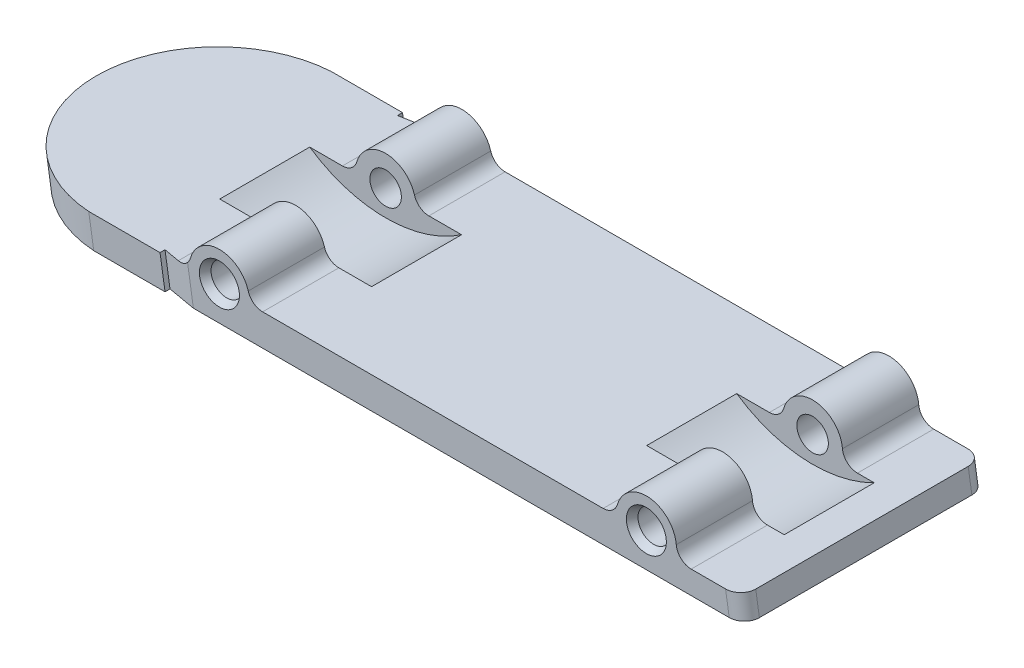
from build123d import *
from OCP.BRepFilletAPI import BRepFilletAPI_MakeChamfer

# Parameters (mm, degrees)
SKETCH1_R           = 0.8001
BOSS_EXTRUDE1_DEPTH = 12.319
CUT_EXTRUDE1_DEPTH  = 12.319
CUT_EXTRUDE2_DEPTH  = 6.1595
CUT_EXTRUDE3_DEPTH  = 2.286
CHAMFER1_SIZE       = 0.2159
CHAMFER1_SIZE2      = 0.373949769
FILLET1_R           = 0.762
FILLET2_R           = 0.762


with BuildPart() as part:
    # Sketch1 → Boss-Extrude1 (new body)
    with BuildSketch(Plane.XY):
        with BuildLine():
            Line((0, 0), (-0.253446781, 1.6002))
            Line((-0.253446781, 1.6002), (9.96475014, 1.6002))
            ThreePointArc((9.96475014, 1.6002), (10.422655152, 1.753129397), (10.696761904, 2.150533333))
            ThreePointArc((10.696761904, 2.150533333), (12.160785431, 3.2512), (13.624808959, 2.150533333))
            ThreePointArc((13.624808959, 2.150533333), (13.898915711, 1.753129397), (14.356820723, 1.6002))
            Line((14.356820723, 1.6002), (31.65635014, 1.6002))
            ThreePointArc((31.65635014, 1.6002), (32.114255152, 1.753129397), (32.388361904, 2.150533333))
            ThreePointArc((32.388361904, 2.150533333), (33.998824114, 3.244148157), (35.370352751, 1.862666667))
            ThreePointArc((35.370352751, 1.862666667), (35.615025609, 1.368147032), (36.12933641, 1.1684))
            Line((36.12933641, 1.1684), (38.647031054, 1.1684))
            Line((38.647031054, 1.1684), (38.832087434, 0))
            Line((38.832087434, 0), (0, 0))
        make_face()
        with Locations(Location((12.160785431, 1.7272, 0), (0, 0, 180))):
            Circle(SKETCH1_R, mode=Mode.SUBTRACT)
        with Locations(Location((33.852385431, 1.7272, 0), (0, 0, 180))):
            Circle(SKETCH1_R, mode=Mode.SUBTRACT)
    extrude(amount=BOSS_EXTRUDE1_DEPTH)

    # Sketch2 → Cut-Extrude1 (cut, along a direction that is not the sketch's normal)
    with BuildSketch(Plane(origin=(0, 1.6002, 0), x_dir=(1, 0, 0), z_dir=(0, 1, 0))):
        with BuildLine():
            ThreePointArc((5.523010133, -12.319), (1.416606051, -10.381670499), (-0.253446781, -6.159500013))
            Line((-0.253446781, -6.159500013), (-0.253446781, -12.319))
            Line((-0.253446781, -12.319), (5.523010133, -12.319))
        make_face()
        with BuildLine():
            ThreePointArc((-0.253446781, -6.159500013), (1.416606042, -1.93732951), (5.523010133, 0))
            Line((5.523010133, 0), (-0.253446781, 0))
            Line((-0.253446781, 0), (-0.253446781, -6.159500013))
        make_face()
    extrude(amount=-CUT_EXTRUDE1_DEPTH, dir=(-0.15643446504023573, 0.987688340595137, 0), mode=Mode.SUBTRACT)

    # Sketch4 → Cut-Extrude2 (cut, symmetric, along a direction that is not the sketch's normal)
    with BuildSketch(Plane(origin=(0, 1.6002, 0), x_dir=(1, 0, 0), z_dir=(0, 1, 0))):
        Polygon((9.144553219, 0), (9.144553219, -0.254), (10.585058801, 0), align=None)
        Polygon((9.144553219, -12.319), (10.585058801, -12.319), (9.144553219, -12.065), align=None)
    extrude(amount=CUT_EXTRUDE2_DEPTH, dir=(-0.1564344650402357, 0.987688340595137, 0), both=True, mode=Mode.SUBTRACT)

    # Sketch5 → Cut-Extrude3 (cut, symmetric)
    with BuildSketch(Plane.XY.offset(6.1595)):
        with BuildLine():
            Line((5.91803305, 4.431967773), (18.169658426, 3.965627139))
            ThreePointArc((18.169658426, 3.965627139), (11.899934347, 0.417980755), (5.91803305, 4.431967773))
        make_face()
        with BuildLine():
            Line((27.728970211, 4.182984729), (40.034635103, 4.3025247))
            ThreePointArc((40.034635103, 4.3025247), (33.919002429, 0.413341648), (27.728970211, 4.182984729))
        make_face()
    extrude(amount=CUT_EXTRUDE3_DEPTH, both=True, mode=Mode.SUBTRACT)

    # Chamfer1: one chamfer whose edges measure the first distance from different faces: ONE call of the kernel's chamfer builder (chamfer() names one face for all edges)
    chamfer1_edges_1 = [part.edges().sort_by_distance(p)[0] for p in [
        (12.960885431, 1.7272, 0),
    ]]
    chamfer1_side_1 = [part.faces().sort_by_distance(p)[0] for p in [
        (12.960885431, 1.7272, 1.93675),
    ]]
    chamfer1_edges_2 = [part.edges().sort_by_distance(p)[0] for p in [
        (12.960885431, 1.7272, 12.319),
        (34.652485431, 1.7272, 12.319),
    ]]
    chamfer1_side_2 = [part.faces().sort_by_distance(p)[0] for p in [
        (24.217354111, 0.964486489, 12.319),
    ]]
    chamfer1_edges_3 = [part.edges().sort_by_distance(p)[0] for p in [
        (34.652485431, 1.7272, 0),
    ]]
    chamfer1_side_3 = [part.faces().sort_by_distance(p)[0] for p in [
        (34.652485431, 1.7272, 1.93675),
    ]]
    chamfer1 = BRepFilletAPI_MakeChamfer(part.part.solid().wrapped)
    for e in chamfer1_edges_1:
        chamfer1.Add(CHAMFER1_SIZE, CHAMFER1_SIZE2, e.wrapped, chamfer1_side_1[0].wrapped)  # the first distance lies on this face
    for e in chamfer1_edges_2:
        chamfer1.Add(CHAMFER1_SIZE, CHAMFER1_SIZE2, e.wrapped, chamfer1_side_2[0].wrapped)  # the first distance lies on this face
    for e in chamfer1_edges_3:
        chamfer1.Add(CHAMFER1_SIZE, CHAMFER1_SIZE2, e.wrapped, chamfer1_side_3[0].wrapped)  # the first distance lies on this face
    add(Compound.cast(chamfer1.Shape()), mode=Mode.REPLACE)

    # Fillet1
    fillet1_edges = [part.edges().sort_by_distance(p)[0] for p in [
        (38.739559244, 0.5842, 12.319),
    ]]
    fillet(fillet1_edges, radius=FILLET1_R)

    # Fillet2
    fillet2_edges = [part.edges().sort_by_distance(p)[0] for p in [
        (38.739559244, 0.5842, 0),
    ]]
    fillet(fillet2_edges, radius=FILLET2_R)


solid = part.part
